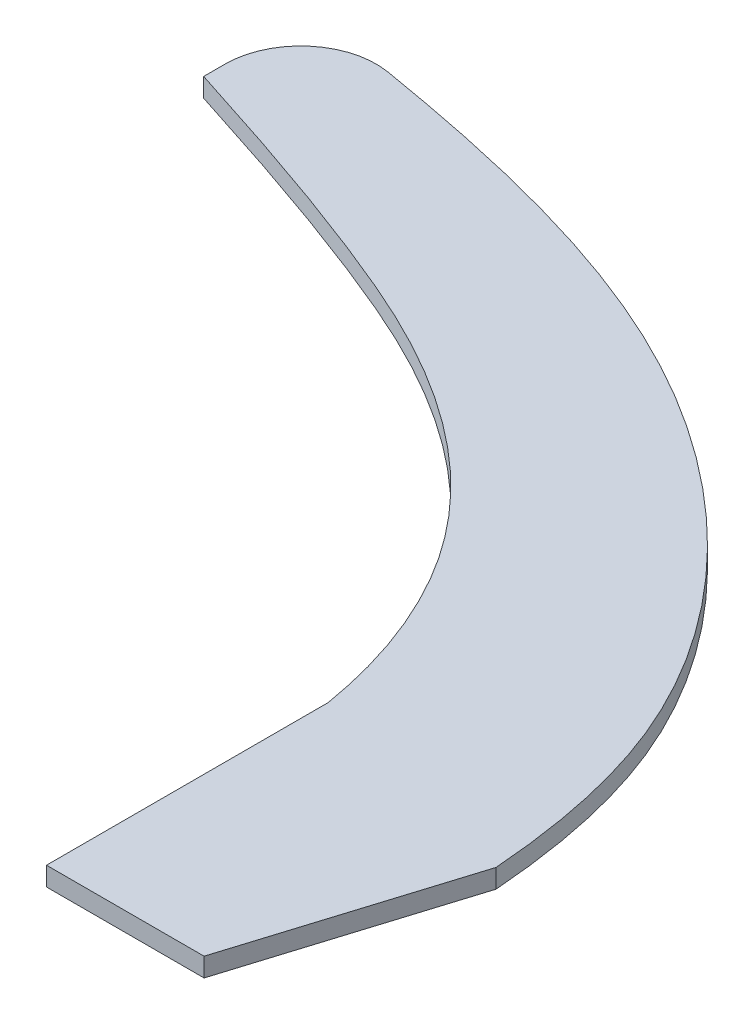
ISO-10303-21;
HEADER;
FILE_DESCRIPTION(('STEP AP214'),'2;1');
FILE_NAME('part.step','',(''),(''),'','','');
FILE_SCHEMA(('AUTOMOTIVE_DESIGN { 1 0 10303 214 1 1 1 1 }'));
ENDSEC;
DATA;
#1=APPLICATION_CONTEXT('core data for automotive mechanical design processes');
#2=APPLICATION_PROTOCOL_DEFINITION('international standard','automotive_design',2000,#1);
#3=PRODUCT_CONTEXT('',#1,'mechanical');
#4=PRODUCT('Part','Part','',(#3));
#5=PRODUCT_RELATED_PRODUCT_CATEGORY('part','',(#4));
#6=PRODUCT_DEFINITION_FORMATION('','',#4);
#7=PRODUCT_DEFINITION_CONTEXT('part definition',#1,'design');
#8=PRODUCT_DEFINITION('design','',#6,#7);
#9=PRODUCT_DEFINITION_SHAPE('','',#8);
#10=(LENGTH_UNIT() NAMED_UNIT(*) SI_UNIT(.MILLI.,.METRE.));
#11=(NAMED_UNIT(*) PLANE_ANGLE_UNIT() SI_UNIT($,.RADIAN.));
#12=(NAMED_UNIT(*) SI_UNIT($,.STERADIAN.) SOLID_ANGLE_UNIT());
#13=UNCERTAINTY_MEASURE_WITH_UNIT(LENGTH_MEASURE(1.E-05),#10,'distance_accuracy_value','');
#14=(GEOMETRIC_REPRESENTATION_CONTEXT(3) GLOBAL_UNCERTAINTY_ASSIGNED_CONTEXT((#13)) GLOBAL_UNIT_ASSIGNED_CONTEXT((#10,
#11,#12)) REPRESENTATION_CONTEXT('',''));
#15=CARTESIAN_POINT('',(0.,0.,0.));
#16=DIRECTION('',(0.,0.,1.));
#17=DIRECTION('',(1.,0.,0.));
#18=AXIS2_PLACEMENT_3D('',#15,#16,#17);
#19=CARTESIAN_POINT('',(-276.080212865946,6.35,-304.304256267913));
#20=CARTESIAN_POINT('',(-249.39702884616,6.35,-295.816675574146));
#21=CARTESIAN_POINT('',(-215.313087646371,6.35,-284.497873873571));
#22=CARTESIAN_POINT('',(-147.777683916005,6.35,-255.872844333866));
#23=CARTESIAN_POINT('',(-106.217359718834,6.35,-225.424204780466));
#24=CARTESIAN_POINT('',(-80.1625209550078,6.35,-174.044765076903));
#25=CARTESIAN_POINT('',(-75.0894864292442,6.35,-155.98481076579));
#26=CARTESIAN_POINT('',(-72.8802128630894,6.35,-142.977188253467));
#27=B_SPLINE_CURVE_WITH_KNOTS('',3,(#19,#20,#21,#22,#23,#24,#25,#26),.UNSPECIFIED.,.F.,.F.,(4,1,
1,1,1,4),(0.204924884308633,0.390633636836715,0.440251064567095,0.672116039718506,
0.710668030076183,0.796787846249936),.UNSPECIFIED.);
#28=DIRECTION('',(0.,-1.,0.));
#29=VECTOR('',#28,1.);
#30=SURFACE_OF_LINEAR_EXTRUSION('',#27,#29);
#31=CARTESIAN_POINT('',(-276.080212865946,0.,-304.304256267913));
#32=CARTESIAN_POINT('',(-249.39702884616,0.,-295.816675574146));
#33=CARTESIAN_POINT('',(-215.313087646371,0.,-284.497873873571));
#34=CARTESIAN_POINT('',(-147.777683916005,0.,-255.872844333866));
#35=CARTESIAN_POINT('',(-106.217359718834,0.,-225.424204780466));
#36=CARTESIAN_POINT('',(-80.1625209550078,0.,-174.044765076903));
#37=CARTESIAN_POINT('',(-75.0894864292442,0.,-155.98481076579));
#38=CARTESIAN_POINT('',(-72.8802128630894,0.,-142.977188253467));
#39=B_SPLINE_CURVE_WITH_KNOTS('',3,(#31,#32,#33,#34,#35,#36,#37,#38),.UNSPECIFIED.,.F.,.F.,(4,1,
1,1,1,4),(0.204924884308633,0.390633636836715,0.440251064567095,0.672116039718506,
0.710668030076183,0.796787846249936),.UNSPECIFIED.);
#40=CARTESIAN_POINT('',(-276.080212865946,0.,-304.304256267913));
#41=VERTEX_POINT('',#40);
#42=CARTESIAN_POINT('',(-72.8802128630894,0.,-142.977188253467));
#43=VERTEX_POINT('',#42);
#44=EDGE_CURVE('E125',#41,#43,#39,.T.);
#45=ORIENTED_EDGE('',*,*,#44,.T.);
#46=DIRECTION('',(0.,-1.,0.));
#47=VECTOR('',#46,1.);
#48=CARTESIAN_POINT('',(-72.8802128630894,6.35,-142.977188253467));
#49=LINE('',#48,#47);
#50=CARTESIAN_POINT('',(-72.8802128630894,6.35,-142.977188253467));
#51=VERTEX_POINT('',#50);
#52=EDGE_CURVE('E11',#51,#43,#49,.T.);
#53=ORIENTED_EDGE('',*,*,#52,.F.);
#54=CARTESIAN_POINT('',(-276.080212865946,6.35,-304.304256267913));
#55=VERTEX_POINT('',#54);
#56=EDGE_CURVE('E147',#55,#51,#27,.T.);
#57=ORIENTED_EDGE('',*,*,#56,.F.);
#58=DIRECTION('',(0.,-1.,0.));
#59=VECTOR('',#58,1.);
#60=CARTESIAN_POINT('',(-276.080212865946,6.35,-304.304256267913));
#61=LINE('',#60,#59);
#62=EDGE_CURVE('E118',#55,#41,#61,.T.);
#63=ORIENTED_EDGE('',*,*,#62,.T.);
#64=EDGE_LOOP('',(#45,#53,#57,#63));
#65=FACE_BOUND('',#64,.T.);
#66=ADVANCED_FACE('F31',(#65),#30,.F.);
#67=CARTESIAN_POINT('',(-72.8802128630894,6.35,-48.26));
#68=DIRECTION('',(1.,0.,0.));
#69=DIRECTION('',(0.,0.,-1.));
#70=AXIS2_PLACEMENT_3D('',#67,#68,#69);
#71=PLANE('',#70);
#72=DIRECTION('',(0.,0.,1.));
#73=VECTOR('',#72,1.);
#74=CARTESIAN_POINT('',(-72.8802128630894,0.,-48.26));
#75=LINE('',#74,#73);
#76=CARTESIAN_POINT('',(-72.8802128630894,0.,-48.26));
#77=VERTEX_POINT('',#76);
#78=EDGE_CURVE('E130',#43,#77,#75,.T.);
#79=ORIENTED_EDGE('',*,*,#78,.T.);
#80=DIRECTION('',(0.,-1.,0.));
#81=VECTOR('',#80,1.);
#82=CARTESIAN_POINT('',(-72.8802128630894,6.35,-48.26));
#83=LINE('',#82,#81);
#84=CARTESIAN_POINT('',(-72.8802128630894,6.35,-48.26));
#85=VERTEX_POINT('',#84);
#86=EDGE_CURVE('E40',#85,#77,#83,.T.);
#87=ORIENTED_EDGE('',*,*,#86,.F.);
#88=DIRECTION('',(0.,0.,1.));
#89=VECTOR('',#88,1.);
#90=CARTESIAN_POINT('',(-72.8802128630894,6.35,-48.26));
#91=LINE('',#90,#89);
#92=EDGE_CURVE('E88',#51,#85,#91,.T.);
#93=ORIENTED_EDGE('',*,*,#92,.F.);
#94=ORIENTED_EDGE('',*,*,#52,.T.);
#95=EDGE_LOOP('',(#79,#87,#93,#94));
#96=FACE_BOUND('',#95,.T.);
#97=ADVANCED_FACE('F177',(#96),#71,.F.);
#98=CARTESIAN_POINT('',(-19.9053194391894,6.35,-48.26));
#99=DIRECTION('',(0.,0.,-1.));
#100=DIRECTION('',(-1.,0.,0.));
#101=AXIS2_PLACEMENT_3D('',#98,#99,#100);
#102=PLANE('',#101);
#103=DIRECTION('',(1.,0.,0.));
#104=VECTOR('',#103,1.);
#105=CARTESIAN_POINT('',(-19.9053194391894,0.,-48.26));
#106=LINE('',#105,#104);
#107=CARTESIAN_POINT('',(-19.9053194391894,0.,-48.26));
#108=VERTEX_POINT('',#107);
#109=EDGE_CURVE('E135',#77,#108,#106,.T.);
#110=ORIENTED_EDGE('',*,*,#109,.T.);
#111=DIRECTION('',(0.,-1.,0.));
#112=VECTOR('',#111,1.);
#113=CARTESIAN_POINT('',(-19.9053194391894,6.35,-48.26));
#114=LINE('',#113,#112);
#115=CARTESIAN_POINT('',(-19.9053194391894,6.35,-48.26));
#116=VERTEX_POINT('',#115);
#117=EDGE_CURVE('E151',#116,#108,#114,.T.);
#118=ORIENTED_EDGE('',*,*,#117,.F.);
#119=DIRECTION('',(1.,0.,0.));
#120=VECTOR('',#119,1.);
#121=CARTESIAN_POINT('',(-19.9053194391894,6.35,-48.26));
#122=LINE('',#121,#120);
#123=EDGE_CURVE('E159',#85,#116,#122,.T.);
#124=ORIENTED_EDGE('',*,*,#123,.F.);
#125=ORIENTED_EDGE('',*,*,#86,.T.);
#126=EDGE_LOOP('',(#110,#118,#124,#125));
#127=FACE_BOUND('',#126,.T.);
#128=ADVANCED_FACE('F157',(#127),#102,.F.);
#129=CARTESIAN_POINT('',(3.31978713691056,6.35,-123.182472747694));
#130=DIRECTION('',(-0.955160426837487,0.,-0.296088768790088));
#131=DIRECTION('',(-0.296088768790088,0.,0.955160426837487));
#132=AXIS2_PLACEMENT_3D('',#129,#130,#131);
#133=PLANE('',#132);
#134=DIRECTION('',(0.296088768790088,0.,-0.955160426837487));
#135=VECTOR('',#134,1.);
#136=CARTESIAN_POINT('',(3.31978713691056,0.,-123.182472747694));
#137=LINE('',#136,#135);
#138=CARTESIAN_POINT('',(3.31978713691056,0.,-123.182472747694));
#139=VERTEX_POINT('',#138);
#140=EDGE_CURVE('E137',#108,#139,#137,.T.);
#141=ORIENTED_EDGE('',*,*,#140,.T.);
#142=DIRECTION('',(0.,-1.,0.));
#143=VECTOR('',#142,1.);
#144=CARTESIAN_POINT('',(3.31978713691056,6.35,-123.182472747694));
#145=LINE('',#144,#143);
#146=CARTESIAN_POINT('',(3.31978713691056,6.35,-123.182472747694));
#147=VERTEX_POINT('',#146);
#148=EDGE_CURVE('E113',#147,#139,#145,.T.);
#149=ORIENTED_EDGE('',*,*,#148,.F.);
#150=DIRECTION('',(0.296088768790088,0.,-0.955160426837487));
#151=VECTOR('',#150,1.);
#152=CARTESIAN_POINT('',(3.31978713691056,6.35,-123.182472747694));
#153=LINE('',#152,#151);
#154=EDGE_CURVE('E104',#116,#147,#153,.T.);
#155=ORIENTED_EDGE('',*,*,#154,.F.);
#156=ORIENTED_EDGE('',*,*,#117,.T.);
#157=EDGE_LOOP('',(#141,#149,#155,#156));
#158=FACE_BOUND('',#157,.T.);
#159=ADVANCED_FACE('F165',(#158),#133,.F.);
#160=CARTESIAN_POINT('',(3.31978713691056,6.35,-123.182472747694));
#161=CARTESIAN_POINT('',(1.72995999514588,6.35,-144.350911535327));
#162=CARTESIAN_POINT('',(-10.6377479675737,6.35,-212.558405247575));
#163=CARTESIAN_POINT('',(-101.308396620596,6.35,-305.399197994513));
#164=CARTESIAN_POINT('',(-196.449017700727,6.35,-328.131034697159));
#165=CARTESIAN_POINT('',(-246.452645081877,6.35,-336.571350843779));
#166=B_SPLINE_CURVE_WITH_KNOTS('',3,(#160,#161,#162,#163,#164,#165),.UNSPECIFIED.,.F.,.F.,(4,1,
1,4),(0.156420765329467,0.291931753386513,0.595968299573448,0.916312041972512),.UNSPECIFIED.);
#167=DIRECTION('',(0.,-1.,0.));
#168=VECTOR('',#167,1.);
#169=SURFACE_OF_LINEAR_EXTRUSION('',#166,#168);
#170=CARTESIAN_POINT('',(3.31978713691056,0.,-123.182472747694));
#171=CARTESIAN_POINT('',(1.72995999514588,0.,-144.350911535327));
#172=CARTESIAN_POINT('',(-10.6377479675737,0.,-212.558405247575));
#173=CARTESIAN_POINT('',(-101.308396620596,0.,-305.399197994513));
#174=CARTESIAN_POINT('',(-196.449017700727,0.,-328.131034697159));
#175=CARTESIAN_POINT('',(-246.452645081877,0.,-336.571350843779));
#176=B_SPLINE_CURVE_WITH_KNOTS('',3,(#170,#171,#172,#173,#174,#175),.UNSPECIFIED.,.F.,.F.,(4,1,
1,4),(0.156420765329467,0.291931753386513,0.595968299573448,0.916312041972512),.UNSPECIFIED.);
#177=CARTESIAN_POINT('',(-246.452645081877,0.,-336.571350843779));
#178=VERTEX_POINT('',#177);
#179=EDGE_CURVE('E112',#139,#178,#176,.T.);
#180=ORIENTED_EDGE('',*,*,#179,.T.);
#181=DIRECTION('',(0.,-1.,0.));
#182=VECTOR('',#181,1.);
#183=CARTESIAN_POINT('',(-246.452645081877,6.35,-336.571350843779));
#184=LINE('',#183,#182);
#185=CARTESIAN_POINT('',(-246.452645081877,6.35,-336.571350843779));
#186=VERTEX_POINT('',#185);
#187=EDGE_CURVE('E109',#186,#178,#184,.T.);
#188=ORIENTED_EDGE('',*,*,#187,.F.);
#189=EDGE_CURVE('E98',#147,#186,#166,.T.);
#190=ORIENTED_EDGE('',*,*,#189,.F.);
#191=ORIENTED_EDGE('',*,*,#148,.T.);
#192=EDGE_LOOP('',(#180,#188,#190,#191));
#193=FACE_BOUND('',#192,.T.);
#194=ADVANCED_FACE('F110',(#193),#169,.F.);
#195=CARTESIAN_POINT('',(-250.680212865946,6.35,-311.525639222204));
#196=DIRECTION('',(0.,-1.,0.));
#197=DIRECTION('',(0.,0.,-1.));
#198=AXIS2_PLACEMENT_3D('',#195,#196,#197);
#199=CYLINDRICAL_SURFACE('',#198,25.4);
#200=CARTESIAN_POINT('',(-250.680212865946,0.,-311.525639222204));
#201=DIRECTION('',(0.,1.,0.));
#202=DIRECTION('',(0.,0.,1.));
#203=AXIS2_PLACEMENT_3D('',#200,#201,#202);
#204=CIRCLE('',#203,25.4);
#205=CARTESIAN_POINT('',(-276.080212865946,0.,-311.525639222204));
#206=VERTEX_POINT('',#205);
#207=EDGE_CURVE('E74',#178,#206,#204,.T.);
#208=ORIENTED_EDGE('',*,*,#207,.T.);
#209=DIRECTION('',(0.,-1.,0.));
#210=VECTOR('',#209,1.);
#211=CARTESIAN_POINT('',(-276.080212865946,6.35,-311.525639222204));
#212=LINE('',#211,#210);
#213=CARTESIAN_POINT('',(-276.080212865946,6.35,-311.525639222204));
#214=VERTEX_POINT('',#213);
#215=EDGE_CURVE('E114',#214,#206,#212,.T.);
#216=ORIENTED_EDGE('',*,*,#215,.F.);
#217=CARTESIAN_POINT('',(-250.680212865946,6.35,-311.525639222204));
#218=DIRECTION('',(0.,1.,0.));
#219=DIRECTION('',(0.,0.,1.));
#220=AXIS2_PLACEMENT_3D('',#217,#218,#219);
#221=CIRCLE('',#220,25.4);
#222=EDGE_CURVE('E102',#186,#214,#221,.T.);
#223=ORIENTED_EDGE('',*,*,#222,.F.);
#224=ORIENTED_EDGE('',*,*,#187,.T.);
#225=EDGE_LOOP('',(#208,#216,#223,#224));
#226=FACE_BOUND('',#225,.T.);
#227=ADVANCED_FACE('F116',(#226),#199,.T.);
#228=CARTESIAN_POINT('',(-276.080212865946,6.35,-304.304256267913));
#229=DIRECTION('',(1.,0.,0.));
#230=DIRECTION('',(0.,0.,-1.));
#231=AXIS2_PLACEMENT_3D('',#228,#229,#230);
#232=PLANE('',#231);
#233=DIRECTION('',(0.,0.,1.));
#234=VECTOR('',#233,1.);
#235=CARTESIAN_POINT('',(-276.080212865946,0.,-304.304256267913));
#236=LINE('',#235,#234);
#237=EDGE_CURVE('E80',#206,#41,#236,.T.);
#238=ORIENTED_EDGE('',*,*,#237,.T.);
#239=ORIENTED_EDGE('',*,*,#62,.F.);
#240=DIRECTION('',(0.,0.,1.));
#241=VECTOR('',#240,1.);
#242=CARTESIAN_POINT('',(-276.080212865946,6.35,-304.304256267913));
#243=LINE('',#242,#241);
#244=EDGE_CURVE('E48',#214,#55,#243,.T.);
#245=ORIENTED_EDGE('',*,*,#244,.F.);
#246=ORIENTED_EDGE('',*,*,#215,.T.);
#247=EDGE_LOOP('',(#238,#239,#245,#246));
#248=FACE_BOUND('',#247,.T.);
#249=ADVANCED_FACE('F191',(#248),#232,.F.);
#250=CARTESIAN_POINT('',(-149.166240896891,6.35,-253.133254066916));
#251=DIRECTION('',(0.,-1.,0.));
#252=DIRECTION('',(0.,0.,-1.));
#253=AXIS2_PLACEMENT_3D('',#250,#251,#252);
#254=PLANE('',#253);
#255=ORIENTED_EDGE('',*,*,#56,.T.);
#256=ORIENTED_EDGE('',*,*,#92,.T.);
#257=ORIENTED_EDGE('',*,*,#123,.T.);
#258=ORIENTED_EDGE('',*,*,#154,.T.);
#259=ORIENTED_EDGE('',*,*,#189,.T.);
#260=ORIENTED_EDGE('',*,*,#222,.T.);
#261=ORIENTED_EDGE('',*,*,#244,.T.);
#262=EDGE_LOOP('',(#255,#256,#257,#258,#259,#260,#261));
#263=FACE_BOUND('',#262,.T.);
#264=ADVANCED_FACE('F100',(#263),#254,.F.);
#265=CARTESIAN_POINT('',(-149.166240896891,0.,-253.133254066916));
#266=DIRECTION('',(0.,-1.,0.));
#267=DIRECTION('',(0.,0.,-1.));
#268=AXIS2_PLACEMENT_3D('',#265,#266,#267);
#269=PLANE('',#268);
#270=ORIENTED_EDGE('',*,*,#44,.F.);
#271=ORIENTED_EDGE('',*,*,#237,.F.);
#272=ORIENTED_EDGE('',*,*,#207,.F.);
#273=ORIENTED_EDGE('',*,*,#179,.F.);
#274=ORIENTED_EDGE('',*,*,#140,.F.);
#275=ORIENTED_EDGE('',*,*,#109,.F.);
#276=ORIENTED_EDGE('',*,*,#78,.F.);
#277=EDGE_LOOP('',(#270,#271,#272,#273,#274,#275,#276));
#278=FACE_BOUND('',#277,.T.);
#279=ADVANCED_FACE('F163',(#278),#269,.T.);
#280=CLOSED_SHELL('',(#66,#97,#128,#159,#194,#227,#249,#264,#279));
#281=MANIFOLD_SOLID_BREP('B2',#280);
#282=ADVANCED_BREP_SHAPE_REPRESENTATION('',(#18,#281),#14);
#283=SHAPE_DEFINITION_REPRESENTATION(#9,#282);
ENDSEC;
END-ISO-10303-21;
